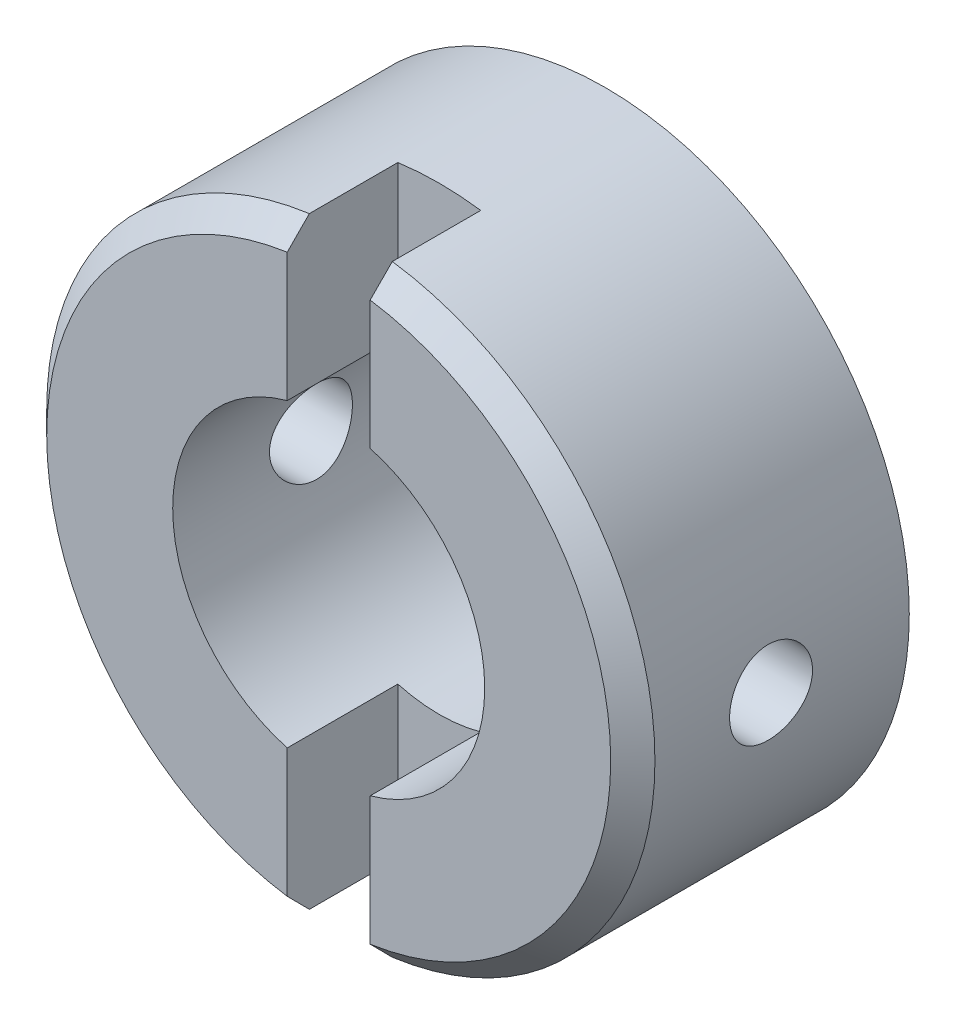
from build123d import *

# Parameters (mm, degrees)
SKETCH1_R               = 11
SKETCH1_R_2             = 5.642858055
BASENUT_DEPTH           = 10
CHAMFER1_SIZE           = 0.8
CUT_EXTRUDE1_DEPTH      = 4
CUT_EXTRUDE2_DEPTH      = 19.493242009
CUT_EXTRUDE2_DEPTH_BACK = 19.493242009
SKETCH3_R               = 1.5
ENDCHAMFER_SIZE         = 0.4


with BuildPart() as part:
    # Sketch1 → BaseNut (new body)
    with BuildSketch(Plane.XY):
        Circle(SKETCH1_R)
        Circle(SKETCH1_R_2, mode=Mode.SUBTRACT)
    extrude(amount=-BASENUT_DEPTH)

    # Chamfer1
    chamfer1_edges = [part.edges().sort_by_distance(p)[0] for p in [
        (-11, 0, 0),
    ]]
    chamfer(chamfer1_edges, length=CHAMFER1_SIZE)

    # Sketch2 → Cut-Extrude1 (cut)
    with BuildSketch(Plane(origin=(-6.092906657, -5.364082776, 0), x_dir=(1, 0, 0), z_dir=(0, 0, 1))):
        with BuildLine():
            Line((4.592906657, 16.261330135), (4.592906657, -5.533164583))
            ThreePointArc((4.592906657, -5.533164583), (6.092906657, -5.635917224), (7.592906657, -5.533164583))
            Line((7.592906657, -5.533164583), (7.592906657, 16.261330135))
            ThreePointArc((7.592906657, 16.261330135), (6.092906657, 16.364082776), (4.592906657, 16.261330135))
        make_face()
    extrude(amount=-CUT_EXTRUDE1_DEPTH, mode=Mode.SUBTRACT)

    # Sketch3 → Cut-Extrude2 (cut, two sides: drawn at the far end of the back side and taken through both)
    with BuildSketch(Plane(origin=(0, 0, 0), x_dir=(0, 0, -1), z_dir=(1, 0, 0)).offset(-CUT_EXTRUDE2_DEPTH_BACK)):
        with Locations((5, 0)):
            Circle(SKETCH3_R)
    extrude(amount=CUT_EXTRUDE2_DEPTH + CUT_EXTRUDE2_DEPTH_BACK, mode=Mode.SUBTRACT)

    # EndChamfer
    endchamfer_edges = [part.edges().sort_by_distance(p)[0] for p in [
        (-5.642858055, 0, -10),
    ]]
    chamfer(endchamfer_edges, length=ENDCHAMFER_SIZE)


solid = part.part
